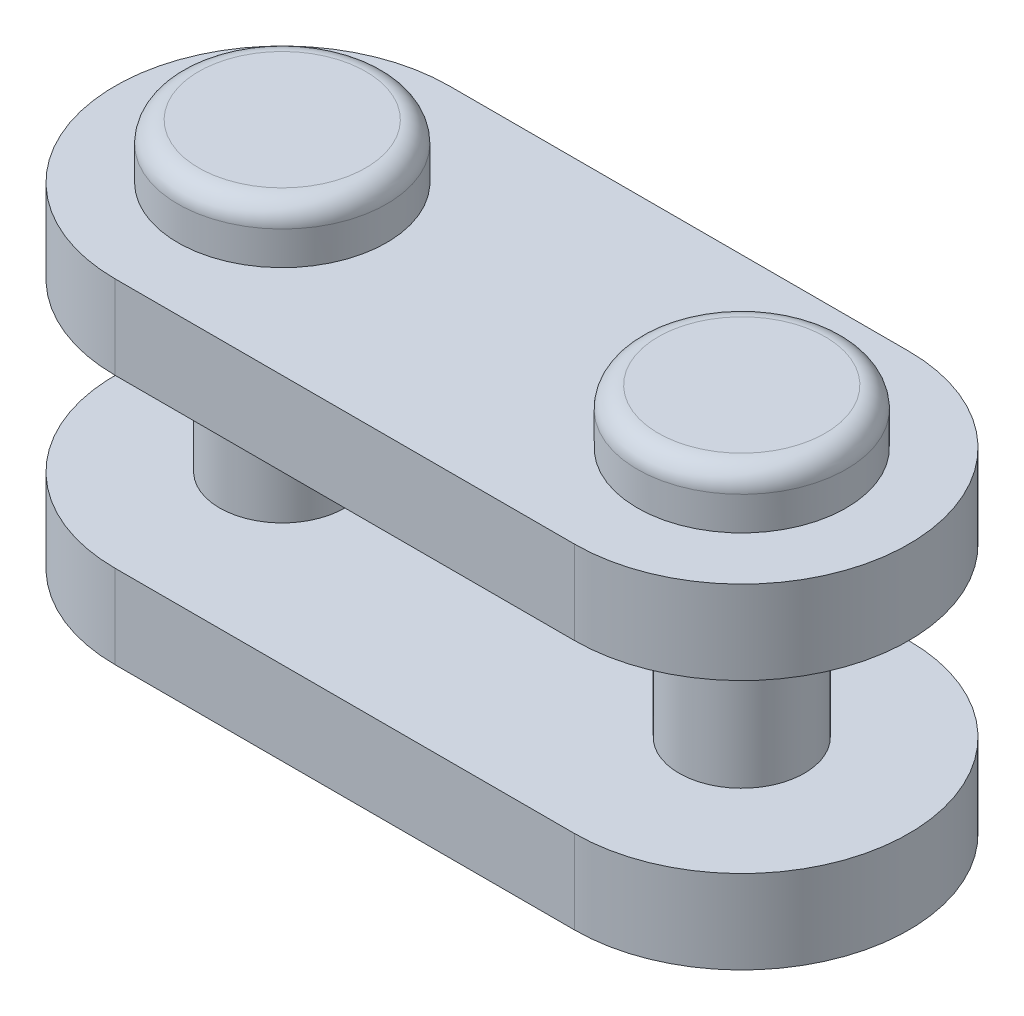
ISO-10303-21;
HEADER;
FILE_DESCRIPTION(('STEP AP214'),'2;1');
FILE_NAME('part.step','',(''),(''),'','','');
FILE_SCHEMA(('AUTOMOTIVE_DESIGN { 1 0 10303 214 1 1 1 1 }'));
ENDSEC;
DATA;
#1=APPLICATION_CONTEXT('core data for automotive mechanical design processes');
#2=APPLICATION_PROTOCOL_DEFINITION('international standard','automotive_design',2000,#1);
#3=PRODUCT_CONTEXT('',#1,'mechanical');
#4=PRODUCT('Part','Part','',(#3));
#5=PRODUCT_RELATED_PRODUCT_CATEGORY('part','',(#4));
#6=PRODUCT_DEFINITION_FORMATION('','',#4);
#7=PRODUCT_DEFINITION_CONTEXT('part definition',#1,'design');
#8=PRODUCT_DEFINITION('design','',#6,#7);
#9=PRODUCT_DEFINITION_SHAPE('','',#8);
#10=(LENGTH_UNIT() NAMED_UNIT(*) SI_UNIT(.MILLI.,.METRE.));
#11=(NAMED_UNIT(*) PLANE_ANGLE_UNIT() SI_UNIT($,.RADIAN.));
#12=(NAMED_UNIT(*) SI_UNIT($,.STERADIAN.) SOLID_ANGLE_UNIT());
#13=UNCERTAINTY_MEASURE_WITH_UNIT(LENGTH_MEASURE(1.E-05),#10,'distance_accuracy_value','');
#14=(GEOMETRIC_REPRESENTATION_CONTEXT(3) GLOBAL_UNCERTAINTY_ASSIGNED_CONTEXT((#13)) GLOBAL_UNIT_ASSIGNED_CONTEXT((#10,
#11,#12)) REPRESENTATION_CONTEXT('',''));
#15=CARTESIAN_POINT('',(0.,0.,0.));
#16=DIRECTION('',(0.,0.,1.));
#17=DIRECTION('',(1.,0.,0.));
#18=AXIS2_PLACEMENT_3D('',#15,#16,#17);
#19=CARTESIAN_POINT('',(11.0000000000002,-5.3,2.28983498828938E-13));
#20=DIRECTION('',(0.,1.,0.));
#21=DIRECTION('',(-0.871208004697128,0.,-0.490914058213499));
#22=AXIS2_PLACEMENT_3D('',#19,#20,#21);
#23=PLANE('',#22);
#24=CARTESIAN_POINT('',(11.0000000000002,-5.3,2.25483030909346E-13));
#25=DIRECTION('',(0.,1.,0.));
#26=DIRECTION('',(-0.871208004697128,0.,-0.490914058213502));
#27=AXIS2_PLACEMENT_3D('',#24,#25,#26);
#28=CIRCLE('',#27,2.00000000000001);
#29=CARTESIAN_POINT('',(9.25758399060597,-5.3,-0.981828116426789));
#30=VERTEX_POINT('',#29);
#31=CARTESIAN_POINT('',(12.7424160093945,-5.3,0.981828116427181));
#32=VERTEX_POINT('',#31);
#33=EDGE_CURVE('E249',#30,#32,#28,.T.);
#34=ORIENTED_EDGE('',*,*,#33,.F.);
#35=CARTESIAN_POINT('',(11.0000000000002,-5.3,2.25483030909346E-13));
#36=DIRECTION('',(0.,1.,0.));
#37=DIRECTION('',(0.871208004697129,0.,0.4909140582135));
#38=AXIS2_PLACEMENT_3D('',#35,#36,#37);
#39=CIRCLE('',#38,2.00000000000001);
#40=EDGE_CURVE('E245',#32,#30,#39,.T.);
#41=ORIENTED_EDGE('',*,*,#40,.F.);
#42=EDGE_LOOP('',(#34,#41));
#43=FACE_BOUND('',#42,.T.);
#44=ADVANCED_FACE('F17',(#43),#23,.F.);
#45=CARTESIAN_POINT('',(11.0000000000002,-4.8,2.25514051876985E-13));
#46=DIRECTION('',(0.,1.,0.));
#47=DIRECTION('',(-0.871208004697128,0.,-0.490914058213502));
#48=AXIS2_PLACEMENT_3D('',#45,#46,#47);
#49=TOROIDAL_SURFACE('',#48,2.00000000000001,0.5);
#50=ORIENTED_EDGE('',*,*,#33,.T.);
#51=ORIENTED_EDGE('',*,*,#40,.T.);
#52=EDGE_LOOP('',(#50,#51));
#53=FACE_BOUND('',#52,.T.);
#54=CARTESIAN_POINT('',(11.0000000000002,-4.8,2.25514051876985E-13));
#55=DIRECTION('',(0.,-1.,0.));
#56=DIRECTION('',(0.871208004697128,0.,0.490914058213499));
#57=AXIS2_PLACEMENT_3D('',#54,#55,#56);
#58=CIRCLE('',#57,2.5);
#59=CARTESIAN_POINT('',(13.1780200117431,-4.8,1.22728514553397));
#60=VERTEX_POINT('',#59);
#61=EDGE_CURVE('E178',#60,#60,#58,.F.);
#62=ORIENTED_EDGE('',*,*,#61,.F.);
#63=EDGE_LOOP('',(#62));
#64=FACE_BOUND('',#63,.T.);
#65=ADVANCED_FACE('F231',(#53,#64),#49,.T.);
#66=CARTESIAN_POINT('',(11.0000000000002,-4.,2.25514051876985E-13));
#67=DIRECTION('',(0.,-1.,0.));
#68=DIRECTION('',(0.871208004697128,0.,0.490914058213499));
#69=AXIS2_PLACEMENT_3D('',#66,#67,#68);
#70=CYLINDRICAL_SURFACE('',#69,2.5);
#71=ORIENTED_EDGE('',*,*,#61,.T.);
#72=EDGE_LOOP('',(#71));
#73=FACE_BOUND('',#72,.T.);
#74=CARTESIAN_POINT('',(11.0000000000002,-4.,2.25514051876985E-13));
#75=DIRECTION('',(0.,1.,0.));
#76=DIRECTION('',(-1.,0.,0.));
#77=AXIS2_PLACEMENT_3D('',#74,#75,#76);
#78=CIRCLE('',#77,2.5);
#79=CARTESIAN_POINT('',(8.50000000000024,-4.,2.25514051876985E-13));
#80=VERTEX_POINT('',#79);
#81=EDGE_CURVE('E114',#80,#80,#78,.T.);
#82=ORIENTED_EDGE('',*,*,#81,.F.);
#83=EDGE_LOOP('',(#82));
#84=FACE_BOUND('',#83,.T.);
#85=ADVANCED_FACE('F344',(#73,#84),#70,.T.);
#86=CARTESIAN_POINT('',(11.0000000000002,-4.,0.));
#87=DIRECTION('',(0.,1.,0.));
#88=DIRECTION('',(-0.999999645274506,0.,0.000842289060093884));
#89=AXIS2_PLACEMENT_3D('',#86,#87,#88);
#90=PLANE('',#89);
#91=ORIENTED_EDGE('',*,*,#81,.T.);
#92=EDGE_LOOP('',(#91));
#93=FACE_BOUND('',#92,.T.);
#94=DIRECTION('',(-1.,0.,0.));
#95=VECTOR('',#94,1.);
#96=CARTESIAN_POINT('',(11.,-4.,4.));
#97=LINE('',#96,#95);
#98=CARTESIAN_POINT('',(11.,-4.,4.));
#99=VERTEX_POINT('',#98);
#100=CARTESIAN_POINT('',(0.,-4.,4.));
#101=VERTEX_POINT('',#100);
#102=EDGE_CURVE('E187',#99,#101,#97,.T.);
#103=ORIENTED_EDGE('',*,*,#102,.T.);
#104=CARTESIAN_POINT('',(0.,-4.,0.));
#105=DIRECTION('',(0.,-1.,0.));
#106=DIRECTION('',(0.999999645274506,0.,-0.000842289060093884));
#107=AXIS2_PLACEMENT_3D('',#104,#105,#106);
#108=CIRCLE('',#107,4.00000000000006);
#109=CARTESIAN_POINT('',(0.,-4.,-4.00000000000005));
#110=VERTEX_POINT('',#109);
#111=EDGE_CURVE('E180',#110,#101,#108,.F.);
#112=ORIENTED_EDGE('',*,*,#111,.F.);
#113=DIRECTION('',(1.,0.,0.));
#114=VECTOR('',#113,1.);
#115=CARTESIAN_POINT('',(11.0000000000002,-4.,-4.));
#116=LINE('',#115,#114);
#117=CARTESIAN_POINT('',(11.0000000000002,-4.,-4.));
#118=VERTEX_POINT('',#117);
#119=EDGE_CURVE('E183',#110,#118,#116,.T.);
#120=ORIENTED_EDGE('',*,*,#119,.T.);
#121=CARTESIAN_POINT('',(11.0000000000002,-4.,0.));
#122=DIRECTION('',(0.,-1.,0.));
#123=DIRECTION('',(0.999999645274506,0.,-0.000842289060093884));
#124=AXIS2_PLACEMENT_3D('',#121,#122,#123);
#125=CIRCLE('',#124,4.);
#126=EDGE_CURVE('E169',#99,#118,#125,.F.);
#127=ORIENTED_EDGE('',*,*,#126,.F.);
#128=EDGE_LOOP('',(#103,#112,#120,#127));
#129=FACE_BOUND('',#128,.T.);
#130=CARTESIAN_POINT('',(0.,-4.,0.));
#131=DIRECTION('',(0.,1.,0.));
#132=DIRECTION('',(-1.,0.,0.));
#133=AXIS2_PLACEMENT_3D('',#130,#131,#132);
#134=CIRCLE('',#133,2.5);
#135=CARTESIAN_POINT('',(-2.50000000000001,-4.,0.));
#136=VERTEX_POINT('',#135);
#137=EDGE_CURVE('E11',#136,#136,#134,.T.);
#138=ORIENTED_EDGE('',*,*,#137,.T.);
#139=EDGE_LOOP('',(#138));
#140=FACE_BOUND('',#139,.T.);
#141=ADVANCED_FACE('F349',(#93,#129,#140),#90,.F.);
#142=CARTESIAN_POINT('',(0.,3.9999999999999,0.));
#143=DIRECTION('',(0.,-1.,0.));
#144=DIRECTION('',(0.526985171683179,0.,-0.849874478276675));
#145=AXIS2_PLACEMENT_3D('',#142,#143,#144);
#146=CYLINDRICAL_SURFACE('',#145,1.5);
#147=CARTESIAN_POINT('',(0.,-2.,0.));
#148=DIRECTION('',(0.,1.,0.));
#149=DIRECTION('',(-0.999240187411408,0.,-0.0389749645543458));
#150=AXIS2_PLACEMENT_3D('',#147,#148,#149);
#151=CIRCLE('',#150,1.5);
#152=CARTESIAN_POINT('',(-1.49886028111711,-2.,-0.0584624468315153));
#153=VERTEX_POINT('',#152);
#154=EDGE_CURVE('E145',#153,#153,#151,.F.);
#155=ORIENTED_EDGE('',*,*,#154,.F.);
#156=EDGE_LOOP('',(#155));
#157=FACE_BOUND('',#156,.T.);
#158=CARTESIAN_POINT('',(0.,1.99999999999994,0.));
#159=DIRECTION('',(0.,1.,0.));
#160=DIRECTION('',(-0.999240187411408,0.,-0.0389749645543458));
#161=AXIS2_PLACEMENT_3D('',#158,#159,#160);
#162=CIRCLE('',#161,1.5);
#163=CARTESIAN_POINT('',(-1.49886028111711,1.99999999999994,-0.0584624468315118));
#164=VERTEX_POINT('',#163);
#165=EDGE_CURVE('E378',#164,#164,#162,.F.);
#166=ORIENTED_EDGE('',*,*,#165,.T.);
#167=EDGE_LOOP('',(#166));
#168=FACE_BOUND('',#167,.T.);
#169=ADVANCED_FACE('F355',(#157,#168),#146,.T.);
#170=CARTESIAN_POINT('',(11.0000000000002,4.,2.35922392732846E-13));
#171=DIRECTION('',(0.,-1.,0.));
#172=DIRECTION('',(0.871208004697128,0.,0.490914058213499));
#173=AXIS2_PLACEMENT_3D('',#170,#171,#172);
#174=CYLINDRICAL_SURFACE('',#173,1.5);
#175=CARTESIAN_POINT('',(11.0000000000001,1.99999999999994,0.));
#176=DIRECTION('',(0.,1.,0.));
#177=DIRECTION('',(-0.999999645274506,0.,0.000842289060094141));
#178=AXIS2_PLACEMENT_3D('',#175,#176,#177);
#179=CIRCLE('',#178,1.500000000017);
#180=CARTESIAN_POINT('',(9.50000053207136,1.99999999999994,0.00126343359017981));
#181=VERTEX_POINT('',#180);
#182=EDGE_CURVE('E175',#181,#181,#179,.F.);
#183=ORIENTED_EDGE('',*,*,#182,.T.);
#184=EDGE_LOOP('',(#183));
#185=FACE_BOUND('',#184,.T.);
#186=CARTESIAN_POINT('',(11.0000000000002,-2.,0.));
#187=DIRECTION('',(0.,1.,0.));
#188=DIRECTION('',(-0.999999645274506,0.,0.000842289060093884));
#189=AXIS2_PLACEMENT_3D('',#186,#187,#188);
#190=CIRCLE('',#189,1.500000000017);
#191=CARTESIAN_POINT('',(9.5000005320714,-2.,0.0012634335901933));
#192=VERTEX_POINT('',#191);
#193=EDGE_CURVE('E177',#192,#192,#190,.T.);
#194=ORIENTED_EDGE('',*,*,#193,.T.);
#195=EDGE_LOOP('',(#194));
#196=FACE_BOUND('',#195,.T.);
#197=ADVANCED_FACE('F294',(#185,#196),#174,.T.);
#198=CARTESIAN_POINT('',(11.0000000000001,3.99999999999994,0.));
#199=DIRECTION('',(0.,-1.,0.));
#200=DIRECTION('',(0.999999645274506,0.,-0.000842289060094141));
#201=AXIS2_PLACEMENT_3D('',#198,#199,#200);
#202=CYLINDRICAL_SURFACE('',#201,4.);
#203=CARTESIAN_POINT('',(11.0000000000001,1.99999999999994,0.));
#204=DIRECTION('',(0.,-1.,0.));
#205=DIRECTION('',(0.999999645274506,0.,-0.000842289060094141));
#206=AXIS2_PLACEMENT_3D('',#203,#204,#205);
#207=CIRCLE('',#206,4.);
#208=CARTESIAN_POINT('',(11.0000000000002,1.99999999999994,4.));
#209=VERTEX_POINT('',#208);
#210=CARTESIAN_POINT('',(11.0000000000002,1.99999999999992,-4.));
#211=VERTEX_POINT('',#210);
#212=EDGE_CURVE('E103',#209,#211,#207,.F.);
#213=ORIENTED_EDGE('',*,*,#212,.T.);
#214=DIRECTION('',(0.,1.,0.));
#215=VECTOR('',#214,1.);
#216=CARTESIAN_POINT('',(11.0000000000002,3.99999999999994,-4.));
#217=LINE('',#216,#215);
#218=CARTESIAN_POINT('',(11.0000000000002,3.99999999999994,-4.));
#219=VERTEX_POINT('',#218);
#220=EDGE_CURVE('E107',#211,#219,#217,.T.);
#221=ORIENTED_EDGE('',*,*,#220,.T.);
#222=CARTESIAN_POINT('',(11.0000000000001,3.99999999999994,0.));
#223=DIRECTION('',(0.,-1.,0.));
#224=DIRECTION('',(0.999999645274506,0.,-0.000842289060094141));
#225=AXIS2_PLACEMENT_3D('',#222,#223,#224);
#226=CIRCLE('',#225,4.);
#227=CARTESIAN_POINT('',(11.0000000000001,3.99999999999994,4.));
#228=VERTEX_POINT('',#227);
#229=EDGE_CURVE('E133',#228,#219,#226,.F.);
#230=ORIENTED_EDGE('',*,*,#229,.F.);
#231=DIRECTION('',(0.,1.,0.));
#232=VECTOR('',#231,1.);
#233=CARTESIAN_POINT('',(11.0000000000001,3.99999999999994,4.));
#234=LINE('',#233,#232);
#235=EDGE_CURVE('E110',#228,#209,#234,.F.);
#236=ORIENTED_EDGE('',*,*,#235,.T.);
#237=EDGE_LOOP('',(#213,#221,#230,#236));
#238=FACE_BOUND('',#237,.T.);
#239=ADVANCED_FACE('F105',(#238),#202,.T.);
#240=CARTESIAN_POINT('',(11.0000000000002,3.99999999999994,-4.));
#241=DIRECTION('',(0.,0.,1.));
#242=DIRECTION('',(1.,0.,0.));
#243=AXIS2_PLACEMENT_3D('',#240,#241,#242);
#244=PLANE('',#243);
#245=DIRECTION('',(0.,-1.,0.));
#246=VECTOR('',#245,1.);
#247=CARTESIAN_POINT('',(0.,3.99999999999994,-4.0000000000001));
#248=LINE('',#247,#246);
#249=CARTESIAN_POINT('',(0.,3.99999999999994,-4.00000000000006));
#250=VERTEX_POINT('',#249);
#251=CARTESIAN_POINT('',(0.,1.99999999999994,-4.));
#252=VERTEX_POINT('',#251);
#253=EDGE_CURVE('E130',#250,#252,#248,.T.);
#254=ORIENTED_EDGE('',*,*,#253,.F.);
#255=DIRECTION('',(-1.,0.,0.));
#256=VECTOR('',#255,1.);
#257=CARTESIAN_POINT('',(11.0000000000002,3.99999999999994,-4.));
#258=LINE('',#257,#256);
#259=EDGE_CURVE('E126',#219,#250,#258,.T.);
#260=ORIENTED_EDGE('',*,*,#259,.F.);
#261=ORIENTED_EDGE('',*,*,#220,.F.);
#262=DIRECTION('',(1.,0.,0.));
#263=VECTOR('',#262,1.);
#264=CARTESIAN_POINT('',(11.0000000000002,1.99999999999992,-4.));
#265=LINE('',#264,#263);
#266=EDGE_CURVE('E117',#252,#211,#265,.T.);
#267=ORIENTED_EDGE('',*,*,#266,.F.);
#268=EDGE_LOOP('',(#254,#260,#261,#267));
#269=FACE_BOUND('',#268,.T.);
#270=ADVANCED_FACE('F124',(#269),#244,.F.);
#271=CARTESIAN_POINT('',(0.,3.99999999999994,0.));
#272=DIRECTION('',(0.,-1.,0.));
#273=DIRECTION('',(0.999999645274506,0.,-0.000842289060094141));
#274=AXIS2_PLACEMENT_3D('',#271,#272,#273);
#275=CYLINDRICAL_SURFACE('',#274,4.00000000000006);
#276=CARTESIAN_POINT('',(0.,3.99999999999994,0.));
#277=DIRECTION('',(0.,-1.,0.));
#278=DIRECTION('',(0.999999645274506,0.,-0.000842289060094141));
#279=AXIS2_PLACEMENT_3D('',#276,#277,#278);
#280=CIRCLE('',#279,4.00000000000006);
#281=CARTESIAN_POINT('',(0.,3.99999999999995,4.));
#282=VERTEX_POINT('',#281);
#283=EDGE_CURVE('E135',#250,#282,#280,.F.);
#284=ORIENTED_EDGE('',*,*,#283,.F.);
#285=ORIENTED_EDGE('',*,*,#253,.T.);
#286=CARTESIAN_POINT('',(0.,1.99999999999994,0.));
#287=DIRECTION('',(0.,-1.,0.));
#288=DIRECTION('',(0.999999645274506,0.,-0.000842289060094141));
#289=AXIS2_PLACEMENT_3D('',#286,#287,#288);
#290=CIRCLE('',#289,4.00000000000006);
#291=CARTESIAN_POINT('',(1.02348685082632E-13,1.99999999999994,4.));
#292=VERTEX_POINT('',#291);
#293=EDGE_CURVE('E120',#252,#292,#290,.F.);
#294=ORIENTED_EDGE('',*,*,#293,.T.);
#295=DIRECTION('',(0.,1.,0.));
#296=VECTOR('',#295,1.);
#297=CARTESIAN_POINT('',(1.38777878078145E-13,3.99999999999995,4.));
#298=LINE('',#297,#296);
#299=EDGE_CURVE('E166',#292,#282,#298,.T.);
#300=ORIENTED_EDGE('',*,*,#299,.T.);
#301=EDGE_LOOP('',(#284,#285,#294,#300));
#302=FACE_BOUND('',#301,.T.);
#303=ADVANCED_FACE('F164',(#302),#275,.T.);
#304=CARTESIAN_POINT('',(11.0000000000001,3.99999999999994,4.));
#305=DIRECTION('',(0.,0.,-1.));
#306=DIRECTION('',(-1.,0.,0.));
#307=AXIS2_PLACEMENT_3D('',#304,#305,#306);
#308=PLANE('',#307);
#309=ORIENTED_EDGE('',*,*,#235,.F.);
#310=DIRECTION('',(1.,0.,0.));
#311=VECTOR('',#310,1.);
#312=CARTESIAN_POINT('',(1.38777878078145E-13,3.99999999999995,4.));
#313=LINE('',#312,#311);
#314=EDGE_CURVE('E138',#282,#228,#313,.T.);
#315=ORIENTED_EDGE('',*,*,#314,.F.);
#316=ORIENTED_EDGE('',*,*,#299,.F.);
#317=DIRECTION('',(-1.,0.,0.));
#318=VECTOR('',#317,1.);
#319=CARTESIAN_POINT('',(11.0000000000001,1.99999999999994,4.));
#320=LINE('',#319,#318);
#321=EDGE_CURVE('E132',#209,#292,#320,.T.);
#322=ORIENTED_EDGE('',*,*,#321,.F.);
#323=EDGE_LOOP('',(#309,#315,#316,#322));
#324=FACE_BOUND('',#323,.T.);
#325=ADVANCED_FACE('F156',(#324),#308,.F.);
#326=CARTESIAN_POINT('',(11.0000000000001,1.99999999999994,0.));
#327=DIRECTION('',(0.,1.,0.));
#328=DIRECTION('',(-0.999999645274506,0.,0.000842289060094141));
#329=AXIS2_PLACEMENT_3D('',#326,#327,#328);
#330=PLANE('',#329);
#331=ORIENTED_EDGE('',*,*,#321,.T.);
#332=ORIENTED_EDGE('',*,*,#293,.F.);
#333=ORIENTED_EDGE('',*,*,#266,.T.);
#334=ORIENTED_EDGE('',*,*,#212,.F.);
#335=EDGE_LOOP('',(#331,#332,#333,#334));
#336=FACE_BOUND('',#335,.T.);
#337=ORIENTED_EDGE('',*,*,#182,.F.);
#338=EDGE_LOOP('',(#337));
#339=FACE_BOUND('',#338,.T.);
#340=ORIENTED_EDGE('',*,*,#165,.F.);
#341=EDGE_LOOP('',(#340));
#342=FACE_BOUND('',#341,.T.);
#343=ADVANCED_FACE('F118',(#336,#339,#342),#330,.F.);
#344=CARTESIAN_POINT('',(11.0000000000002,-2.,-4.));
#345=DIRECTION('',(0.,0.,1.));
#346=DIRECTION('',(1.,0.,0.));
#347=AXIS2_PLACEMENT_3D('',#344,#345,#346);
#348=PLANE('',#347);
#349=DIRECTION('',(0.,-1.,0.));
#350=VECTOR('',#349,1.);
#351=CARTESIAN_POINT('',(0.,-2.,-4.00000000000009));
#352=LINE('',#351,#350);
#353=CARTESIAN_POINT('',(0.,-2.,-4.00000000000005));
#354=VERTEX_POINT('',#353);
#355=EDGE_CURVE('E182',#354,#110,#352,.T.);
#356=ORIENTED_EDGE('',*,*,#355,.F.);
#357=DIRECTION('',(-1.,0.,0.));
#358=VECTOR('',#357,1.);
#359=CARTESIAN_POINT('',(11.0000000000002,-2.,-4.));
#360=LINE('',#359,#358);
#361=CARTESIAN_POINT('',(11.0000000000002,-2.,-4.));
#362=VERTEX_POINT('',#361);
#363=EDGE_CURVE('E186',#362,#354,#360,.T.);
#364=ORIENTED_EDGE('',*,*,#363,.F.);
#365=DIRECTION('',(0.,1.,0.));
#366=VECTOR('',#365,1.);
#367=CARTESIAN_POINT('',(11.0000000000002,-2.,-4.));
#368=LINE('',#367,#366);
#369=EDGE_CURVE('E171',#118,#362,#368,.T.);
#370=ORIENTED_EDGE('',*,*,#369,.F.);
#371=ORIENTED_EDGE('',*,*,#119,.F.);
#372=EDGE_LOOP('',(#356,#364,#370,#371));
#373=FACE_BOUND('',#372,.T.);
#374=ADVANCED_FACE('F425',(#373),#348,.F.);
#375=CARTESIAN_POINT('',(11.0000000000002,-2.,0.));
#376=DIRECTION('',(0.,-1.,0.));
#377=DIRECTION('',(0.999999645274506,0.,-0.000842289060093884));
#378=AXIS2_PLACEMENT_3D('',#375,#376,#377);
#379=CYLINDRICAL_SURFACE('',#378,4.);
#380=ORIENTED_EDGE('',*,*,#126,.T.);
#381=ORIENTED_EDGE('',*,*,#369,.T.);
#382=CARTESIAN_POINT('',(11.0000000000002,-2.,0.));
#383=DIRECTION('',(0.,-1.,0.));
#384=DIRECTION('',(0.999999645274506,0.,-0.000842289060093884));
#385=AXIS2_PLACEMENT_3D('',#382,#383,#384);
#386=CIRCLE('',#385,4.);
#387=CARTESIAN_POINT('',(11.0000000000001,-2.,4.));
#388=VERTEX_POINT('',#387);
#389=EDGE_CURVE('E184',#388,#362,#386,.F.);
#390=ORIENTED_EDGE('',*,*,#389,.F.);
#391=DIRECTION('',(0.,1.,0.));
#392=VECTOR('',#391,1.);
#393=CARTESIAN_POINT('',(11.0000000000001,-2.,4.));
#394=LINE('',#393,#392);
#395=EDGE_CURVE('E196',#388,#99,#394,.F.);
#396=ORIENTED_EDGE('',*,*,#395,.T.);
#397=EDGE_LOOP('',(#380,#381,#390,#396));
#398=FACE_BOUND('',#397,.T.);
#399=ADVANCED_FACE('F157',(#398),#379,.T.);
#400=CARTESIAN_POINT('',(11.0000000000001,-2.,4.));
#401=DIRECTION('',(0.,0.,-1.));
#402=DIRECTION('',(-1.,0.,0.));
#403=AXIS2_PLACEMENT_3D('',#400,#401,#402);
#404=PLANE('',#403);
#405=ORIENTED_EDGE('',*,*,#395,.F.);
#406=DIRECTION('',(1.,0.,0.));
#407=VECTOR('',#406,1.);
#408=CARTESIAN_POINT('',(1.59594559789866E-13,-2.,4.));
#409=LINE('',#408,#407);
#410=CARTESIAN_POINT('',(1.02348685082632E-13,-2.,4.));
#411=VERTEX_POINT('',#410);
#412=EDGE_CURVE('E191',#411,#388,#409,.T.);
#413=ORIENTED_EDGE('',*,*,#412,.F.);
#414=DIRECTION('',(0.,1.,0.));
#415=VECTOR('',#414,1.);
#416=CARTESIAN_POINT('',(1.59594559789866E-13,-2.,4.));
#417=LINE('',#416,#415);
#418=EDGE_CURVE('E201',#101,#411,#417,.T.);
#419=ORIENTED_EDGE('',*,*,#418,.F.);
#420=ORIENTED_EDGE('',*,*,#102,.F.);
#421=EDGE_LOOP('',(#405,#413,#419,#420));
#422=FACE_BOUND('',#421,.T.);
#423=ADVANCED_FACE('F448',(#422),#404,.F.);
#424=CARTESIAN_POINT('',(0.,-2.,0.));
#425=DIRECTION('',(0.,-1.,0.));
#426=DIRECTION('',(0.999999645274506,0.,-0.000842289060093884));
#427=AXIS2_PLACEMENT_3D('',#424,#425,#426);
#428=CYLINDRICAL_SURFACE('',#427,4.00000000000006);
#429=CARTESIAN_POINT('',(0.,-2.,0.));
#430=DIRECTION('',(0.,-1.,0.));
#431=DIRECTION('',(0.999999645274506,0.,-0.000842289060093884));
#432=AXIS2_PLACEMENT_3D('',#429,#430,#431);
#433=CIRCLE('',#432,4.00000000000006);
#434=EDGE_CURVE('E188',#354,#411,#433,.F.);
#435=ORIENTED_EDGE('',*,*,#434,.F.);
#436=ORIENTED_EDGE('',*,*,#355,.T.);
#437=ORIENTED_EDGE('',*,*,#111,.T.);
#438=ORIENTED_EDGE('',*,*,#418,.T.);
#439=EDGE_LOOP('',(#435,#436,#437,#438));
#440=FACE_BOUND('',#439,.T.);
#441=ADVANCED_FACE('F433',(#440),#428,.T.);
#442=CARTESIAN_POINT('',(11.0000000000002,-2.,0.));
#443=DIRECTION('',(0.,1.,0.));
#444=DIRECTION('',(-0.999999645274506,0.,0.000842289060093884));
#445=AXIS2_PLACEMENT_3D('',#442,#443,#444);
#446=PLANE('',#445);
#447=ORIENTED_EDGE('',*,*,#434,.T.);
#448=ORIENTED_EDGE('',*,*,#412,.T.);
#449=ORIENTED_EDGE('',*,*,#389,.T.);
#450=ORIENTED_EDGE('',*,*,#363,.T.);
#451=EDGE_LOOP('',(#447,#448,#449,#450));
#452=FACE_BOUND('',#451,.T.);
#453=ORIENTED_EDGE('',*,*,#193,.F.);
#454=EDGE_LOOP('',(#453));
#455=FACE_BOUND('',#454,.T.);
#456=ORIENTED_EDGE('',*,*,#154,.T.);
#457=EDGE_LOOP('',(#456));
#458=FACE_BOUND('',#457,.T.);
#459=ADVANCED_FACE('F154',(#452,#455,#458),#446,.T.);
#460=CARTESIAN_POINT('',(11.0000000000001,3.99999999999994,0.));
#461=DIRECTION('',(0.,1.,0.));
#462=DIRECTION('',(-0.999999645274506,0.,0.000842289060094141));
#463=AXIS2_PLACEMENT_3D('',#460,#461,#462);
#464=PLANE('',#463);
#465=CARTESIAN_POINT('',(0.,3.99999999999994,0.));
#466=DIRECTION('',(0.,1.,0.));
#467=DIRECTION('',(-1.,0.,0.));
#468=AXIS2_PLACEMENT_3D('',#465,#466,#467);
#469=CIRCLE('',#468,2.5);
#470=CARTESIAN_POINT('',(-2.50000000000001,3.99999999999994,0.));
#471=VERTEX_POINT('',#470);
#472=EDGE_CURVE('E26',#471,#471,#469,.T.);
#473=ORIENTED_EDGE('',*,*,#472,.F.);
#474=EDGE_LOOP('',(#473));
#475=FACE_BOUND('',#474,.T.);
#476=CARTESIAN_POINT('',(11.0000000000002,3.99999999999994,2.35922392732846E-13));
#477=DIRECTION('',(0.,1.,0.));
#478=DIRECTION('',(-1.,0.,0.));
#479=AXIS2_PLACEMENT_3D('',#476,#477,#478);
#480=CIRCLE('',#479,2.5);
#481=CARTESIAN_POINT('',(8.50000000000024,3.99999999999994,2.35922392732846E-13));
#482=VERTEX_POINT('',#481);
#483=EDGE_CURVE('E143',#482,#482,#480,.T.);
#484=ORIENTED_EDGE('',*,*,#483,.F.);
#485=EDGE_LOOP('',(#484));
#486=FACE_BOUND('',#485,.T.);
#487=ORIENTED_EDGE('',*,*,#283,.T.);
#488=ORIENTED_EDGE('',*,*,#314,.T.);
#489=ORIENTED_EDGE('',*,*,#229,.T.);
#490=ORIENTED_EDGE('',*,*,#259,.T.);
#491=EDGE_LOOP('',(#487,#488,#489,#490));
#492=FACE_BOUND('',#491,.T.);
#493=ADVANCED_FACE('F150',(#475,#486,#492),#464,.T.);
#494=CARTESIAN_POINT('',(11.0000000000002,5.3,2.35922392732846E-13));
#495=DIRECTION('',(0.,-1.,0.));
#496=DIRECTION('',(0.871208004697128,0.,0.490914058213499));
#497=AXIS2_PLACEMENT_3D('',#494,#495,#496);
#498=PLANE('',#497);
#499=CARTESIAN_POINT('',(11.0000000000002,5.3,2.35953413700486E-13));
#500=DIRECTION('',(0.,-1.,0.));
#501=DIRECTION('',(0.871208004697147,0.,0.490914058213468));
#502=AXIS2_PLACEMENT_3D('',#499,#500,#501);
#503=CIRCLE('',#502,2.00000000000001);
#504=CARTESIAN_POINT('',(12.7424160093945,5.3,0.981828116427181));
#505=VERTEX_POINT('',#504);
#506=CARTESIAN_POINT('',(9.25758399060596,5.3,-0.981828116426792));
#507=VERTEX_POINT('',#506);
#508=EDGE_CURVE('E209',#505,#507,#503,.T.);
#509=ORIENTED_EDGE('',*,*,#508,.F.);
#510=CARTESIAN_POINT('',(11.0000000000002,5.3,2.35953413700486E-13));
#511=DIRECTION('',(0.,-1.,0.));
#512=DIRECTION('',(-0.871208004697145,0.,-0.49091405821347));
#513=AXIS2_PLACEMENT_3D('',#510,#511,#512);
#514=CIRCLE('',#513,2.00000000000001);
#515=EDGE_CURVE('E305',#507,#505,#514,.T.);
#516=ORIENTED_EDGE('',*,*,#515,.F.);
#517=EDGE_LOOP('',(#509,#516));
#518=FACE_BOUND('',#517,.T.);
#519=ADVANCED_FACE('F153',(#518),#498,.F.);
#520=CARTESIAN_POINT('',(11.0000000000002,4.8,2.35922392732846E-13));
#521=DIRECTION('',(0.,-1.,0.));
#522=DIRECTION('',(0.871208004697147,0.,0.490914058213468));
#523=AXIS2_PLACEMENT_3D('',#520,#521,#522);
#524=TOROIDAL_SURFACE('',#523,2.00000000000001,0.5);
#525=ORIENTED_EDGE('',*,*,#508,.T.);
#526=ORIENTED_EDGE('',*,*,#515,.T.);
#527=EDGE_LOOP('',(#525,#526));
#528=FACE_BOUND('',#527,.T.);
#529=CARTESIAN_POINT('',(11.0000000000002,4.8,2.35922392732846E-13));
#530=DIRECTION('',(0.,1.,0.));
#531=DIRECTION('',(-0.871208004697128,0.,-0.490914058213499));
#532=AXIS2_PLACEMENT_3D('',#529,#530,#531);
#533=CIRCLE('',#532,2.5);
#534=CARTESIAN_POINT('',(8.82197998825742,4.8,-1.22728514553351));
#535=VERTEX_POINT('',#534);
#536=EDGE_CURVE('E242',#535,#535,#533,.F.);
#537=ORIENTED_EDGE('',*,*,#536,.F.);
#538=EDGE_LOOP('',(#537));
#539=FACE_BOUND('',#538,.T.);
#540=ADVANCED_FACE('F218',(#528,#539),#524,.T.);
#541=CARTESIAN_POINT('',(11.0000000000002,4.,2.35922392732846E-13));
#542=DIRECTION('',(0.,1.,0.));
#543=DIRECTION('',(-0.871208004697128,0.,-0.490914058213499));
#544=AXIS2_PLACEMENT_3D('',#541,#542,#543);
#545=CYLINDRICAL_SURFACE('',#544,2.5);
#546=ORIENTED_EDGE('',*,*,#536,.T.);
#547=EDGE_LOOP('',(#546));
#548=FACE_BOUND('',#547,.T.);
#549=ORIENTED_EDGE('',*,*,#483,.T.);
#550=EDGE_LOOP('',(#549));
#551=FACE_BOUND('',#550,.T.);
#552=ADVANCED_FACE('F229',(#548,#551),#545,.T.);
#553=CARTESIAN_POINT('',(0.,5.29999999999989,0.));
#554=DIRECTION('',(0.,-1.,0.));
#555=DIRECTION('',(0.526985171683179,0.,-0.849874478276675));
#556=AXIS2_PLACEMENT_3D('',#553,#554,#555);
#557=PLANE('',#556);
#558=CARTESIAN_POINT('',(0.,5.29999999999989,0.));
#559=DIRECTION('',(0.,-1.,0.));
#560=DIRECTION('',(0.52698517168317,0.,-0.849874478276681));
#561=AXIS2_PLACEMENT_3D('',#558,#559,#560);
#562=CIRCLE('',#561,1.99999999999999);
#563=CARTESIAN_POINT('',(1.05397034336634,5.29999999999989,-1.69974895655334));
#564=VERTEX_POINT('',#563);
#565=CARTESIAN_POINT('',(-1.05397034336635,5.29999999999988,1.69974895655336));
#566=VERTEX_POINT('',#565);
#567=EDGE_CURVE('E212',#564,#566,#562,.T.);
#568=ORIENTED_EDGE('',*,*,#567,.F.);
#569=CARTESIAN_POINT('',(0.,5.29999999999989,0.));
#570=DIRECTION('',(0.,-1.,0.));
#571=DIRECTION('',(-0.526985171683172,0.,0.84987447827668));
#572=AXIS2_PLACEMENT_3D('',#569,#570,#571);
#573=CIRCLE('',#572,1.99999999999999);
#574=EDGE_CURVE('E633',#566,#564,#573,.T.);
#575=ORIENTED_EDGE('',*,*,#574,.F.);
#576=EDGE_LOOP('',(#568,#575));
#577=FACE_BOUND('',#576,.T.);
#578=ADVANCED_FACE('F327',(#577),#557,.F.);
#579=CARTESIAN_POINT('',(0.,4.79999999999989,0.));
#580=DIRECTION('',(0.,-1.,0.));
#581=DIRECTION('',(0.52698517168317,0.,-0.849874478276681));
#582=AXIS2_PLACEMENT_3D('',#579,#580,#581);
#583=TOROIDAL_SURFACE('',#582,1.99999999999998,0.5);
#584=ORIENTED_EDGE('',*,*,#567,.T.);
#585=ORIENTED_EDGE('',*,*,#574,.T.);
#586=EDGE_LOOP('',(#584,#585));
#587=FACE_BOUND('',#586,.T.);
#588=CARTESIAN_POINT('',(0.,4.79999999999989,0.));
#589=DIRECTION('',(0.,1.,0.));
#590=DIRECTION('',(-0.526985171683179,0.,0.849874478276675));
#591=AXIS2_PLACEMENT_3D('',#588,#589,#590);
#592=CIRCLE('',#591,2.5);
#593=CARTESIAN_POINT('',(-1.31746292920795,4.79999999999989,2.12468619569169));
#594=VERTEX_POINT('',#593);
#595=EDGE_CURVE('E379',#594,#594,#592,.F.);
#596=ORIENTED_EDGE('',*,*,#595,.F.);
#597=EDGE_LOOP('',(#596));
#598=FACE_BOUND('',#597,.T.);
#599=ADVANCED_FACE('F334',(#587,#598),#583,.T.);
#600=CARTESIAN_POINT('',(0.,3.9999999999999,0.));
#601=DIRECTION('',(0.,1.,0.));
#602=DIRECTION('',(-0.526985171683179,0.,0.849874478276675));
#603=AXIS2_PLACEMENT_3D('',#600,#601,#602);
#604=CYLINDRICAL_SURFACE('',#603,2.5);
#605=ORIENTED_EDGE('',*,*,#595,.T.);
#606=EDGE_LOOP('',(#605));
#607=FACE_BOUND('',#606,.T.);
#608=ORIENTED_EDGE('',*,*,#472,.T.);
#609=EDGE_LOOP('',(#608));
#610=FACE_BOUND('',#609,.T.);
#611=ADVANCED_FACE('F19',(#607,#610),#604,.T.);
#612=CARTESIAN_POINT('',(0.,-5.30000000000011,0.));
#613=DIRECTION('',(0.,1.,0.));
#614=DIRECTION('',(-0.526985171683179,0.,0.849874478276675));
#615=AXIS2_PLACEMENT_3D('',#612,#613,#614);
#616=PLANE('',#615);
#617=CARTESIAN_POINT('',(0.,-5.30000000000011,0.));
#618=DIRECTION('',(0.,1.,0.));
#619=DIRECTION('',(-0.526985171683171,0.,0.84987447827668));
#620=AXIS2_PLACEMENT_3D('',#617,#618,#619);
#621=CIRCLE('',#620,2.00000000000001);
#622=CARTESIAN_POINT('',(-1.05397034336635,-5.30000000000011,1.69974895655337));
#623=VERTEX_POINT('',#622);
#624=CARTESIAN_POINT('',(1.05397034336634,-5.3000000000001,-1.69974895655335));
#625=VERTEX_POINT('',#624);
#626=EDGE_CURVE('E33',#623,#625,#621,.T.);
#627=ORIENTED_EDGE('',*,*,#626,.F.);
#628=CARTESIAN_POINT('',(0.,-5.30000000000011,0.));
#629=DIRECTION('',(0.,1.,0.));
#630=DIRECTION('',(0.526985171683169,0.,-0.849874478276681));
#631=AXIS2_PLACEMENT_3D('',#628,#629,#630);
#632=CIRCLE('',#631,2.00000000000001);
#633=EDGE_CURVE('E384',#625,#623,#632,.T.);
#634=ORIENTED_EDGE('',*,*,#633,.F.);
#635=EDGE_LOOP('',(#627,#634));
#636=FACE_BOUND('',#635,.T.);
#637=ADVANCED_FACE('F368',(#636),#616,.F.);
#638=CARTESIAN_POINT('',(0.,-4.80000000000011,0.));
#639=DIRECTION('',(0.,1.,0.));
#640=DIRECTION('',(-0.526985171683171,0.,0.84987447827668));
#641=AXIS2_PLACEMENT_3D('',#638,#639,#640);
#642=TOROIDAL_SURFACE('',#641,2.00000000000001,0.5);
#643=ORIENTED_EDGE('',*,*,#626,.T.);
#644=ORIENTED_EDGE('',*,*,#633,.T.);
#645=EDGE_LOOP('',(#643,#644));
#646=FACE_BOUND('',#645,.T.);
#647=CARTESIAN_POINT('',(0.,-4.80000000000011,0.));
#648=DIRECTION('',(0.,-1.,0.));
#649=DIRECTION('',(0.526985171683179,0.,-0.849874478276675));
#650=AXIS2_PLACEMENT_3D('',#647,#648,#649);
#651=CIRCLE('',#650,2.5);
#652=CARTESIAN_POINT('',(1.31746292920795,-4.80000000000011,-2.12468619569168));
#653=VERTEX_POINT('',#652);
#654=EDGE_CURVE('E374',#653,#653,#651,.F.);
#655=ORIENTED_EDGE('',*,*,#654,.F.);
#656=EDGE_LOOP('',(#655));
#657=FACE_BOUND('',#656,.T.);
#658=ADVANCED_FACE('F362',(#646,#657),#642,.T.);
#659=CARTESIAN_POINT('',(0.,-4.00000000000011,0.));
#660=DIRECTION('',(0.,-1.,0.));
#661=DIRECTION('',(0.526985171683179,0.,-0.849874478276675));
#662=AXIS2_PLACEMENT_3D('',#659,#660,#661);
#663=CYLINDRICAL_SURFACE('',#662,2.5);
#664=ORIENTED_EDGE('',*,*,#654,.T.);
#665=EDGE_LOOP('',(#664));
#666=FACE_BOUND('',#665,.T.);
#667=ORIENTED_EDGE('',*,*,#137,.F.);
#668=EDGE_LOOP('',(#667));
#669=FACE_BOUND('',#668,.T.);
#670=ADVANCED_FACE('F360',(#666,#669),#663,.T.);
#671=CLOSED_SHELL('',(#44,#65,#85,#141,#169,#197,#239,#270,#303,#325,#343,#374,#399,#423,#441,
#459,#493,#519,#540,#552,#578,#599,#611,#637,#658,#670));
#672=MANIFOLD_SOLID_BREP('B1',#671);
#673=ADVANCED_BREP_SHAPE_REPRESENTATION('',(#18,#672),#14);
#674=SHAPE_DEFINITION_REPRESENTATION(#9,#673);
ENDSEC;
END-ISO-10303-21;
